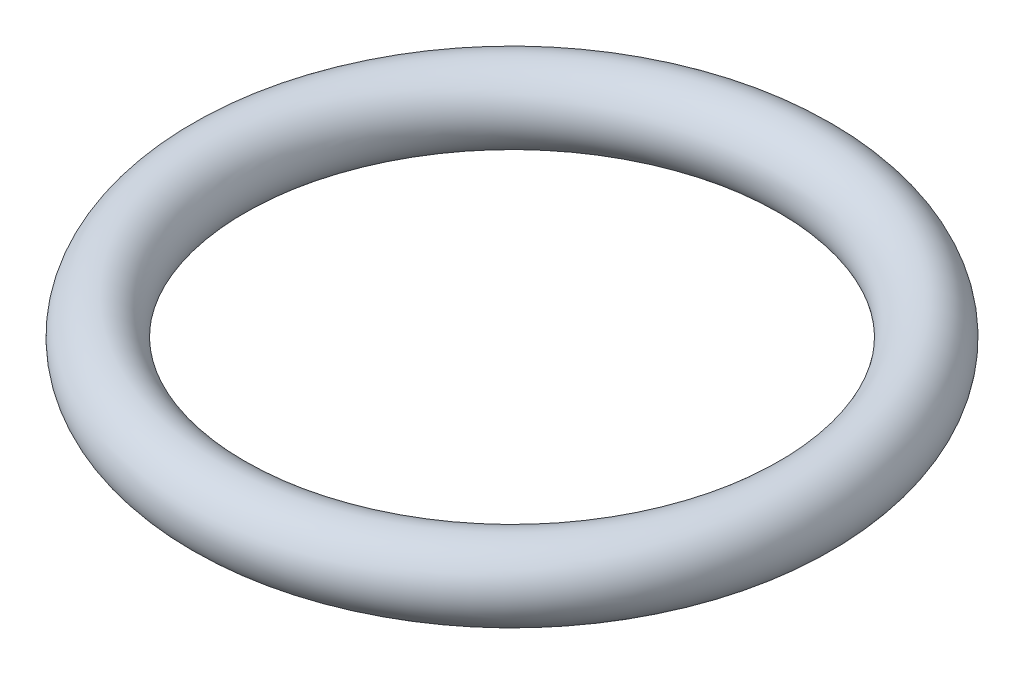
from build123d import *

# Parameters (mm, degrees)
SKETCH1_R = 1


with BuildPart() as part:
    # Sketch1 → Revolve1 (revolve)
    with BuildSketch(Plane.XY, mode=Mode.PRIVATE) as revolve1_sk:
        with Locations((-8, 0)):
            Circle(SKETCH1_R)
    revolve(revolve1_sk.sketch.rotate(Axis((0, 55, 0), (0, -1, 0)), 270), axis=Axis((0, 55, 0), (0, -1, 0)))


solid = part.part
